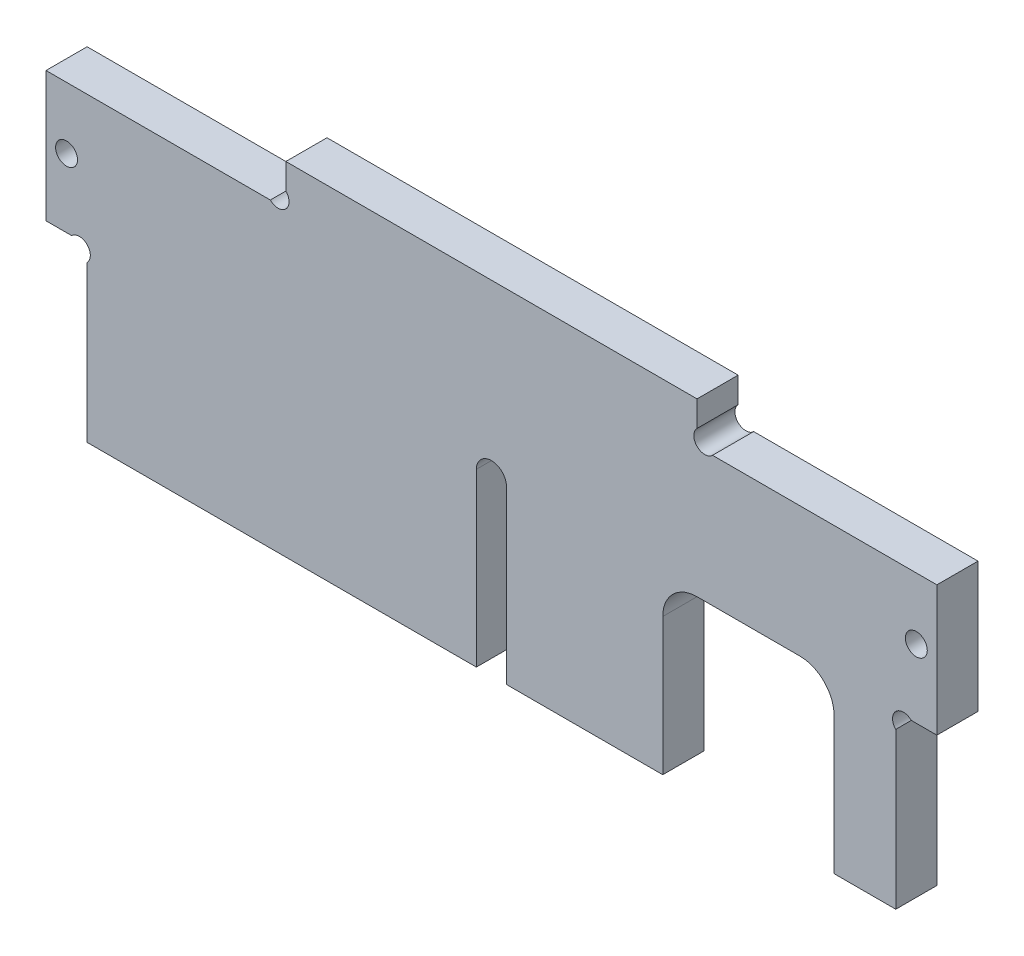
from build123d import *

# Parameters (mm, degrees)
ESQUISSE1_R        = 1.6
BOSS_EXTRU_1_DEPTH = 6


with BuildPart() as part:
    # Esquisse1 → Boss.-Extru.1 (new body)
    with BuildSketch(Plane.XY):
        with BuildLine():
            Line((30, 46.2627417), (30, 50))
            Line((30, 50), (-30, 50))
            Line((-30, 50), (-30, 46.2627417))
            ThreePointArc((-30, 46.2627417), (-30, 44), (-32.2627417, 44))
            Line((-32.2627417, 44), (-65, 44))
            Line((-65, 44), (-65, 25))
            Line((-65, 25), (-61.2627417, 25))
            ThreePointArc((-61.2627417, 25), (-59, 25), (-59, 22.7372583))
            Line((-59, 22.7372583), (-59, 0))
            Line((-59, 0), (-2.2, 0))
            Line((-2.2, 0), (-2.2, 25))
            ThreePointArc((-2.2, 25), (0, 27.2), (2.2, 25))
            Line((2.2, 25), (2.2, 0))
            Line((2.2, 0), (25, 0))
            Line((25, 0), (25, 20))
            ThreePointArc((25, 20), (26.464466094, 23.535533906), (30, 25))
            Line((30, 25), (45, 25))
            ThreePointArc((45, 25), (48.535533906, 23.535533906), (50, 20))
            Line((50, 20), (50, 0))
            Line((50, 0), (59, 0))
            Line((59, 0), (59, 22.7372583))
            ThreePointArc((59, 22.7372583), (59, 25), (61.2627417, 25))
            Line((61.2627417, 25), (65, 25))
            Line((65, 25), (65, 44))
            Line((65, 44), (32.2627417, 44))
            ThreePointArc((32.2627417, 44), (30, 44), (30, 46.2627417))
        make_face()
        with Locations((62, 35)):
            Circle(ESQUISSE1_R, mode=Mode.SUBTRACT)
        with Locations(Location((-62, 35, 0), (0, 0, 180))):
            Circle(ESQUISSE1_R, mode=Mode.SUBTRACT)
    extrude(amount=BOSS_EXTRU_1_DEPTH)


solid = part.part
